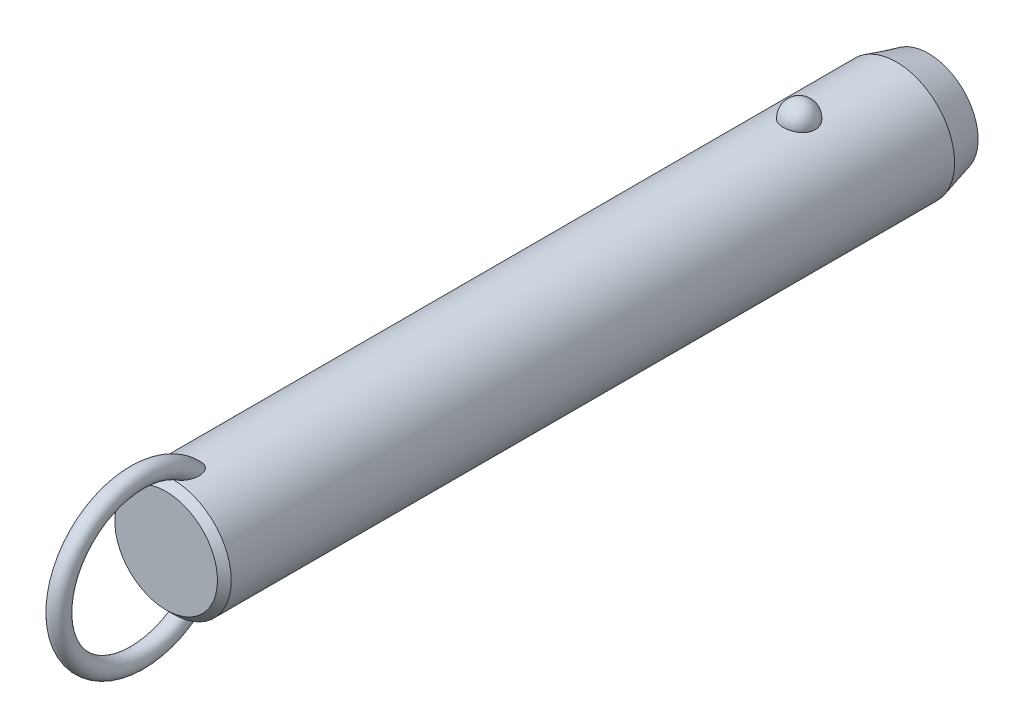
ISO-10303-21;
HEADER;
FILE_DESCRIPTION(('STEP AP214'),'2;1');
FILE_NAME('part.step','',(''),(''),'','','');
FILE_SCHEMA(('AUTOMOTIVE_DESIGN { 1 0 10303 214 1 1 1 1 }'));
ENDSEC;
DATA;
#1=APPLICATION_CONTEXT('core data for automotive mechanical design processes');
#2=APPLICATION_PROTOCOL_DEFINITION('international standard','automotive_design',2000,#1);
#3=PRODUCT_CONTEXT('',#1,'mechanical');
#4=PRODUCT('Part','Part','',(#3));
#5=PRODUCT_RELATED_PRODUCT_CATEGORY('part','',(#4));
#6=PRODUCT_DEFINITION_FORMATION('','',#4);
#7=PRODUCT_DEFINITION_CONTEXT('part definition',#1,'design');
#8=PRODUCT_DEFINITION('design','',#6,#7);
#9=PRODUCT_DEFINITION_SHAPE('','',#8);
#10=(LENGTH_UNIT() NAMED_UNIT(*) SI_UNIT(.MILLI.,.METRE.));
#11=(NAMED_UNIT(*) PLANE_ANGLE_UNIT() SI_UNIT($,.RADIAN.));
#12=(NAMED_UNIT(*) SI_UNIT($,.STERADIAN.) SOLID_ANGLE_UNIT());
#13=UNCERTAINTY_MEASURE_WITH_UNIT(LENGTH_MEASURE(1.E-05),#10,'distance_accuracy_value','');
#14=(GEOMETRIC_REPRESENTATION_CONTEXT(3) GLOBAL_UNCERTAINTY_ASSIGNED_CONTEXT((#13)) GLOBAL_UNIT_ASSIGNED_CONTEXT((#10,
#11,#12)) REPRESENTATION_CONTEXT('',''));
#15=CARTESIAN_POINT('',(0.,0.,0.));
#16=DIRECTION('',(0.,0.,1.));
#17=DIRECTION('',(1.,0.,0.));
#18=AXIS2_PLACEMENT_3D('',#15,#16,#17);
#19=CARTESIAN_POINT('',(0.,0.,121.9));
#20=DIRECTION('',(0.,0.,-1.));
#21=DIRECTION('',(-1.,0.,0.));
#22=AXIS2_PLACEMENT_3D('',#19,#20,#21);
#23=CYLINDRICAL_SURFACE('',#22,12.7);
#24=CARTESIAN_POINT('',(3.46661256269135,12.2177165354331,-3.5));
#25=CARTESIAN_POINT('',(3.4666090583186,12.2177194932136,-3.30432790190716));
#26=CARTESIAN_POINT('',(3.45063567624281,12.2222841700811,-3.10861112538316));
#27=CARTESIAN_POINT('',(3.38712451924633,12.2400345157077,-2.72271899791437));
#28=CARTESIAN_POINT('',(3.33957415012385,12.2532236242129,-2.53254588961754));
#29=CARTESIAN_POINT('',(3.2141234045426,12.286724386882,-2.16324948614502));
#30=CARTESIAN_POINT('',(3.13623639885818,12.3070329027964,-1.98412136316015));
#31=CARTESIAN_POINT('',(2.95205930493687,12.3525018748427,-1.64180592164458));
#32=CARTESIAN_POINT('',(2.84577003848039,12.3776621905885,-1.47861814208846));
#33=CARTESIAN_POINT('',(2.60688050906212,12.4301712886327,-1.17190583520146));
#34=CARTESIAN_POINT('',(2.47415697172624,12.4575299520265,-1.02847897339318));
#35=CARTESIAN_POINT('',(2.18615174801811,12.5112810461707,-0.766177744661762));
#36=CARTESIAN_POINT('',(2.03087002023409,12.5376734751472,-0.64730342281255));
#37=CARTESIAN_POINT('',(1.70237334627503,12.5864761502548,-0.437732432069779));
#38=CARTESIAN_POINT('',(1.52920948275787,12.6088972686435,-0.346958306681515));
#39=CARTESIAN_POINT('',(1.16944170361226,12.6473352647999,-0.195750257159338));
#40=CARTESIAN_POINT('',(0.982839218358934,12.663352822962,-0.135313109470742));
#41=CARTESIAN_POINT('',(0.604961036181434,12.6869706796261,-0.0473241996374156));
#42=CARTESIAN_POINT('',(0.41382314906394,12.6947125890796,-0.0192185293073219));
#43=CARTESIAN_POINT('',(0.0293827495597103,12.7014203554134,0.0051725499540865));
#44=CARTESIAN_POINT('',(-0.163919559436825,12.7003870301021,0.00146092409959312));
#45=CARTESIAN_POINT('',(-0.544374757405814,12.689735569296,-0.0373939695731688));
#46=CARTESIAN_POINT('',(-0.731575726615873,12.6802364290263,-0.0721015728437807));
#47=CARTESIAN_POINT('',(-1.09733277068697,12.6538333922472,-0.171364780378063));
#48=CARTESIAN_POINT('',(-1.27588869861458,12.6369293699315,-0.235920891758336));
#49=CARTESIAN_POINT('',(-1.6204698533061,12.5973946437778,-0.393548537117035));
#50=CARTESIAN_POINT('',(-1.78641865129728,12.5747321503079,-0.486778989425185));
#51=CARTESIAN_POINT('',(-2.10030671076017,12.5261316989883,-0.699110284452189));
#52=CARTESIAN_POINT('',(-2.24824419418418,12.5001934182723,-0.818213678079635));
#53=CARTESIAN_POINT('',(-2.52491489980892,12.4472906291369,-1.08157124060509));
#54=CARTESIAN_POINT('',(-2.65324222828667,12.4203160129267,-1.22624992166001));
#55=CARTESIAN_POINT('',(-2.88410007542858,12.3687509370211,-1.53528325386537));
#56=CARTESIAN_POINT('',(-2.98662883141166,12.3441606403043,-1.69963924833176));
#57=CARTESIAN_POINT('',(-3.16432417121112,12.2998199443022,-2.04548497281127));
#58=CARTESIAN_POINT('',(-3.23917525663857,12.2801261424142,-2.22714424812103));
#59=CARTESIAN_POINT('',(-3.35800573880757,12.248167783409,-2.6009138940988));
#60=CARTESIAN_POINT('',(-3.4019860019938,12.2359030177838,-2.79302397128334));
#61=CARTESIAN_POINT('',(-3.45784812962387,12.2202347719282,-3.18140279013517));
#62=CARTESIAN_POINT('',(-3.46986123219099,12.2167950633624,-3.37765118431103));
#63=CARTESIAN_POINT('',(-3.46186273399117,12.2190638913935,-3.76943689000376));
#64=CARTESIAN_POINT('',(-3.44185196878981,12.2247721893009,-3.96497421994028));
#65=CARTESIAN_POINT('',(-3.37048652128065,12.2446381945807,-4.34881728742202));
#66=CARTESIAN_POINT('',(-3.31928253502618,12.2587552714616,-4.53715319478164));
#67=CARTESIAN_POINT('',(-3.18693461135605,12.2938237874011,-4.90231727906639));
#68=CARTESIAN_POINT('',(-3.1057895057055,12.3147754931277,-5.07914500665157));
#69=CARTESIAN_POINT('',(-2.91506431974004,12.3613125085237,-5.41732059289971));
#70=CARTESIAN_POINT('',(-2.80533587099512,12.3869217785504,-5.57858147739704));
#71=CARTESIAN_POINT('',(-2.560414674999,12.4398525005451,-5.88013283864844));
#72=CARTESIAN_POINT('',(-2.42522099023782,12.4671740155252,-6.02042254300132));
#73=CARTESIAN_POINT('',(-2.1323357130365,12.5205965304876,-6.27662798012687));
#74=CARTESIAN_POINT('',(-1.97456596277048,12.5466928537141,-6.3924554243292));
#75=CARTESIAN_POINT('',(-1.64115839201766,12.5946384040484,-6.59583547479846));
#76=CARTESIAN_POINT('',(-1.46552179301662,12.6164879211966,-6.68339001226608));
#77=CARTESIAN_POINT('',(-1.10356050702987,12.6532533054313,-6.82682153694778));
#78=CARTESIAN_POINT('',(-0.9173913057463,12.6682500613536,-6.8830698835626));
#79=CARTESIAN_POINT('',(-0.537836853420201,12.6900288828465,-6.96386887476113));
#80=CARTESIAN_POINT('',(-0.344452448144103,12.6968119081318,-6.9884232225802));
#81=CARTESIAN_POINT('',(0.0402577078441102,12.7013667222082,-7.00496469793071));
#82=CARTESIAN_POINT('',(0.231556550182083,12.6993008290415,-6.99753844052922));
#83=CARTESIAN_POINT('',(0.610105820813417,12.6867505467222,-6.9516636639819));
#84=CARTESIAN_POINT('',(0.797356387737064,12.6762664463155,-6.913216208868));
#85=CARTESIAN_POINT('',(1.16186657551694,12.6480587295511,-6.80658431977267));
#86=CARTESIAN_POINT('',(1.33915951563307,12.6303611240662,-6.73850666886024));
#87=CARTESIAN_POINT('',(1.67968518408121,12.5896027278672,-6.5745087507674));
#88=CARTESIAN_POINT('',(1.84291705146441,12.5665416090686,-6.47858678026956));
#89=CARTESIAN_POINT('',(2.15340192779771,12.5171072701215,-6.25982455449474));
#90=CARTESIAN_POINT('',(2.30037831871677,12.4906895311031,-6.13660186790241));
#91=CARTESIAN_POINT('',(2.5717412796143,12.4376567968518,-5.86739587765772));
#92=CARTESIAN_POINT('',(2.69612388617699,12.4110417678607,-5.72140858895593));
#93=CARTESIAN_POINT('',(2.92107785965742,12.360051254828,-5.40794137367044));
#94=CARTESIAN_POINT('',(3.02121329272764,12.3357209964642,-5.24014110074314));
#95=CARTESIAN_POINT('',(3.19236291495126,12.2925446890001,-4.88969865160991));
#96=CARTESIAN_POINT('',(3.26338839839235,12.2736965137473,-4.70706226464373));
#97=CARTESIAN_POINT('',(3.36788038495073,12.245404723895,-4.35469510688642));
#98=CARTESIAN_POINT('',(3.40484026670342,12.2351018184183,-4.18605935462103));
#99=CARTESIAN_POINT('',(3.45420764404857,12.2212564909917,-3.84496058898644));
#100=CARTESIAN_POINT('',(3.46661565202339,12.2177139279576,-3.67249765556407));
#101=CARTESIAN_POINT('',(3.46661256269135,12.2177165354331,-3.5));
#102=B_SPLINE_CURVE_WITH_KNOTS('',3,(#24,#25,#26,#27,#28,#29,#30,#31,#32,#33,#34,#35,#36,#37,
#38,#39,#40,#41,#42,#43,#44,#45,#46,#47,#48,#49,#50,#51,#52,#53,#54,#55,#56,#57,#58,#59,#60,#61,
#62,#63,#64,#65,#66,#67,#68,#69,#70,#71,#72,#73,#74,#75,#76,#77,#78,#79,#80,#81,#82,#83,#84,#85,
#86,#87,#88,#89,#90,#91,#92,#93,#94,#95,#96,#97,#98,#99,#100,#101),.UNSPECIFIED.,.T.,.F.,(4,2,2,
2,2,2,2,2,2,2,2,2,2,2,2,2,2,2,2,2,2,2,2,2,2,2,2,2,2,2,2,2,2,2,2,2,2,2,4),(0.,0.586396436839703,
1.17302689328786,1.7593990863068,2.34575431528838,2.93491084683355,3.52406845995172,
4.11158733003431,4.69904375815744,5.2762784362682,5.85345931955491,6.42265312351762,
6.99185659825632,7.56427334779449,8.136746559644,8.71981013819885,9.3029135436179,
9.89247258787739,10.4820150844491,11.0691335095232,11.6562366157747,12.2405256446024,
12.8248374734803,13.412244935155,13.9996740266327,14.5891883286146,15.1786623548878,
15.7609861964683,16.3432419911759,16.9148635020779,17.4864654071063,18.0560241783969,
18.6256177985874,19.2037609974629,19.7820055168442,20.3699810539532,20.957728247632,
21.4746855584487,21.9916320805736),.UNSPECIFIED.);
#103=CARTESIAN_POINT('',(3.46661256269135,12.2177165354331,-3.5));
#104=VERTEX_POINT('',#103);
#105=EDGE_CURVE('E41',#104,#104,#102,.T.);
#106=ORIENTED_EDGE('',*,*,#105,.T.);
#107=EDGE_LOOP('',(#106));
#108=FACE_BOUND('',#107,.T.);
#109=CARTESIAN_POINT('',(0.,0.,133.1));
#110=DIRECTION('',(0.,0.,1.));
#111=DIRECTION('',(1.,0.,0.));
#112=AXIS2_PLACEMENT_3D('',#109,#110,#111);
#113=CIRCLE('',#112,12.7);
#114=CARTESIAN_POINT('',(12.7,0.,133.1));
#115=VERTEX_POINT('',#114);
#116=EDGE_CURVE('E10',#115,#115,#113,.F.);
#117=ORIENTED_EDGE('',*,*,#116,.T.);
#118=EDGE_LOOP('',(#117));
#119=FACE_BOUND('',#118,.T.);
#120=CARTESIAN_POINT('',(-0.548122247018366,-12.6881662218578,126.843218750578));
#121=CARTESIAN_POINT('',(-0.648865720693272,-12.6838128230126,126.877926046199));
#122=CARTESIAN_POINT('',(-0.746398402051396,-12.6783867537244,126.922042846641));
#123=CARTESIAN_POINT('',(-0.932125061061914,-12.666091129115,127.026764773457));
#124=CARTESIAN_POINT('',(-1.02030388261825,-12.6592192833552,127.087396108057));
#125=CARTESIAN_POINT('',(-1.18487740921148,-12.6448747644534,127.221847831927));
#126=CARTESIAN_POINT('',(-1.26134296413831,-12.637406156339,127.295582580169));
#127=CARTESIAN_POINT('',(-1.4023120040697,-12.6225412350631,127.453604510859));
#128=CARTESIAN_POINT('',(-1.466814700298,-12.6151449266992,127.53789238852));
#129=CARTESIAN_POINT('',(-1.60714786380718,-12.5981718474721,127.749657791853));
#130=CARTESIAN_POINT('',(-1.67725126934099,-12.588900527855,127.880962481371));
#131=CARTESIAN_POINT('',(-1.79536591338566,-12.5725964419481,128.153247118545));
#132=CARTESIAN_POINT('',(-1.84333535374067,-12.5655679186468,128.294244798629));
#133=CARTESIAN_POINT('',(-1.93422576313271,-12.5519624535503,128.637645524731));
#134=CARTESIAN_POINT('',(-1.96788773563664,-12.5466298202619,128.842557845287));
#135=CARTESIAN_POINT('',(-1.9941399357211,-12.542463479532,129.151760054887));
#136=CARTESIAN_POINT('',(-1.99883864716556,-12.5417153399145,129.255298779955));
#137=CARTESIAN_POINT('',(-2.00078003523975,-12.5414074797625,129.46245124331));
#138=CARTESIAN_POINT('',(-1.99802449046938,-12.5418474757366,129.566064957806));
#139=CARTESIAN_POINT('',(-1.98336733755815,-12.5441750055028,129.81032076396));
#140=CARTESIAN_POINT('',(-1.96851430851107,-12.5465291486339,129.950780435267));
#141=CARTESIAN_POINT('',(-1.92707089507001,-12.5529612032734,130.229960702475));
#142=CARTESIAN_POINT('',(-1.90047458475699,-12.5570399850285,130.368680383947));
#143=CARTESIAN_POINT('',(-1.8361912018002,-12.5666008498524,130.64341135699));
#144=CARTESIAN_POINT('',(-1.79850828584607,-12.57208240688,130.779423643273));
#145=CARTESIAN_POINT('',(-1.71223796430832,-12.5841228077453,131.047842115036));
#146=CARTESIAN_POINT('',(-1.66365679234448,-12.5906810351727,131.180250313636));
#147=CARTESIAN_POINT('',(-1.5780450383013,-12.6016176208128,131.38548877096));
#148=CARTESIAN_POINT('',(-1.54477252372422,-12.6057501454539,131.459914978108));
#149=CARTESIAN_POINT('',(-1.47424480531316,-12.6141930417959,131.606839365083));
#150=CARTESIAN_POINT('',(-1.436990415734,-12.6185033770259,131.679337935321));
#151=CARTESIAN_POINT('',(-1.35825795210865,-12.6272207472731,131.821892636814));
#152=CARTESIAN_POINT('',(-1.31678520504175,-12.6316276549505,131.891951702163));
#153=CARTESIAN_POINT('',(-1.22917793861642,-12.6404532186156,132.029070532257));
#154=CARTESIAN_POINT('',(-1.18304514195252,-12.6448718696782,132.096131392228));
#155=CARTESIAN_POINT('',(-1.0724641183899,-12.6547893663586,132.243874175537));
#156=CARTESIAN_POINT('',(-1.00642239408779,-12.6602600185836,132.323384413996));
#157=CARTESIAN_POINT('',(-0.864441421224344,-12.6707460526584,132.473169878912));
#158=CARTESIAN_POINT('',(-0.78851691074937,-12.6757620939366,132.543458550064));
#159=CARTESIAN_POINT('',(-0.65221547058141,-12.6833591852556,132.648680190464));
#160=CARTESIAN_POINT('',(-0.59498203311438,-12.6861973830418,132.687624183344));
#161=CARTESIAN_POINT('',(-0.475269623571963,-12.6912445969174,132.756489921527));
#162=CARTESIAN_POINT('',(-0.412800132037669,-12.6934547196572,132.786427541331));
#163=CARTESIAN_POINT('',(-0.295749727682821,-12.6966636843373,132.829756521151));
#164=CARTESIAN_POINT('',(-0.241949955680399,-12.6978134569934,132.845218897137));
#165=CARTESIAN_POINT('',(-0.132508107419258,-12.6994261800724,132.866884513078));
#166=CARTESIAN_POINT('',(-0.0768679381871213,-12.6998898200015,132.873097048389));
#167=CARTESIAN_POINT('',(0.0347696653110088,-12.7000752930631,132.875583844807));
#168=CARTESIAN_POINT('',(0.0907676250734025,-12.6997954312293,132.871835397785));
#169=CARTESIAN_POINT('',(0.201283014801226,-12.6985255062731,132.854788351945));
#170=CARTESIAN_POINT('',(0.255799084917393,-12.6975348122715,132.841481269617));
#171=CARTESIAN_POINT('',(0.376042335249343,-12.6946091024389,132.80203792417));
#172=CARTESIAN_POINT('',(0.440950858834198,-12.6924943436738,132.773449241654));
#173=CARTESIAN_POINT('',(0.565350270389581,-12.6875639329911,132.706323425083));
#174=CARTESIAN_POINT('',(0.624828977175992,-12.6847467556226,132.667764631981));
#175=CARTESIAN_POINT('',(0.774116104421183,-12.6767252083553,132.556949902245));
#176=CARTESIAN_POINT('',(0.859449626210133,-12.6711344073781,132.478760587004));
#177=CARTESIAN_POINT('',(1.01789440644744,-12.6593922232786,132.310943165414));
#178=CARTESIAN_POINT('',(1.09096902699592,-12.653239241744,132.221282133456));
#179=CARTESIAN_POINT('',(1.22268793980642,-12.6411674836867,132.040265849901));
#180=CARTESIAN_POINT('',(1.28193986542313,-12.6352572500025,131.949345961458));
#181=CARTESIAN_POINT('',(1.39259777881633,-12.6235401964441,131.762792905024));
#182=CARTESIAN_POINT('',(1.44399707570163,-12.6177334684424,131.667155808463));
#183=CARTESIAN_POINT('',(1.53972870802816,-12.6064093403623,131.472273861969));
#184=CARTESIAN_POINT('',(1.58405262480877,-12.6008922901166,131.373024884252));
#185=CARTESIAN_POINT('',(1.66600705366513,-12.5903187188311,131.171772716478));
#186=CARTESIAN_POINT('',(1.70363651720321,-12.5852622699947,131.069769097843));
#187=CARTESIAN_POINT('',(1.77545379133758,-12.5753406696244,130.854358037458));
#188=CARTESIAN_POINT('',(1.80903453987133,-12.5705328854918,130.740745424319));
#189=CARTESIAN_POINT('',(1.86844163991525,-12.5618400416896,130.511457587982));
#190=CARTESIAN_POINT('',(1.89426665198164,-12.5579551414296,130.395782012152));
#191=CARTESIAN_POINT('',(1.9378546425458,-12.5513030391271,130.163007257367));
#192=CARTESIAN_POINT('',(1.95562640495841,-12.5485346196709,130.045909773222));
#193=CARTESIAN_POINT('',(1.98264463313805,-12.5442934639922,129.810747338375));
#194=CARTESIAN_POINT('',(1.99189298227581,-12.5428204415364,129.69268260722));
#195=CARTESIAN_POINT('',(2.00416068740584,-12.540871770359,129.380622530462));
#196=CARTESIAN_POINT('',(1.99944433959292,-12.541631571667,129.186229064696));
#197=CARTESIAN_POINT('',(1.96113755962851,-12.5476846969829,128.800309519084));
#198=CARTESIAN_POINT('',(1.92758341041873,-12.5529723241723,128.608780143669));
#199=CARTESIAN_POINT('',(1.83934342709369,-12.5661532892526,128.282272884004));
#200=CARTESIAN_POINT('',(1.79215440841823,-12.5730485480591,128.14524997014));
#201=CARTESIAN_POINT('',(1.67676242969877,-12.588958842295,127.880445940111));
#202=CARTESIAN_POINT('',(1.60859050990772,-12.597970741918,127.752651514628));
#203=CARTESIAN_POINT('',(1.46583832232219,-12.6152829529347,127.535800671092));
#204=CARTESIAN_POINT('',(1.39525727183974,-12.6233659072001,127.44410500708));
#205=CARTESIAN_POINT('',(1.23992594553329,-12.6395676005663,127.273485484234));
#206=CARTESIAN_POINT('',(1.15517932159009,-12.6476863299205,127.194558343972));
#207=CARTESIAN_POINT('',(0.971995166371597,-12.6630846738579,127.052643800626));
#208=CARTESIAN_POINT('',(0.873456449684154,-12.6703572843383,126.989784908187));
#209=CARTESIAN_POINT('',(0.665847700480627,-12.6829569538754,126.884487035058));
#210=CARTESIAN_POINT('',(0.556784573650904,-12.688285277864,126.842034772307));
#211=CARTESIAN_POINT('',(0.347338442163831,-12.6956226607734,126.784443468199));
#212=CARTESIAN_POINT('',(0.247759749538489,-12.6979816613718,126.766399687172));
#213=CARTESIAN_POINT('',(0.0470218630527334,-12.7003077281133,126.748600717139));
#214=CARTESIAN_POINT('',(-0.0541350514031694,-12.7002779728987,126.748821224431));
#215=CARTESIAN_POINT('',(-0.221414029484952,-12.6982482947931,126.764363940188));
#216=CARTESIAN_POINT('',(-0.288055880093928,-12.6969033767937,126.774666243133));
#217=CARTESIAN_POINT('',(-0.419599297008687,-12.6932369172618,126.80313489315));
#218=CARTESIAN_POINT('',(-0.484501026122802,-12.6909154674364,126.821300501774));
#219=CARTESIAN_POINT('',(-0.548122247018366,-12.6881662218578,126.843218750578));
#220=B_SPLINE_CURVE_WITH_KNOTS('',3,(#120,#121,#122,#123,#124,#125,#126,#127,#128,#129,#130,
#131,#132,#133,#134,#135,#136,#137,#138,#139,#140,#141,#142,#143,#144,#145,#146,#147,#148,#149,
#150,#151,#152,#153,#154,#155,#156,#157,#158,#159,#160,#161,#162,#163,#164,#165,#166,#167,#168,
#169,#170,#171,#172,#173,#174,#175,#176,#177,#178,#179,#180,#181,#182,#183,#184,#185,#186,#187,
#188,#189,#190,#191,#192,#193,#194,#195,#196,#197,#198,#199,#200,#201,#202,#203,#204,#205,#206,
#207,#208,#209,#210,#211,#212,#213,#214,#215,#216,#217,#218,#219),.UNSPECIFIED.,.T.,.F.,(4,2,2,
2,2,2,2,2,2,2,2,2,2,2,2,2,2,2,2,2,2,2,2,2,2,2,2,2,2,2,2,2,2,2,2,2,2,2,2,2,2,2,2,2,2,2,2,2,2,4),
(0.,0.31964225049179,0.639794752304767,0.957927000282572,1.27608021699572,1.72100165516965,
2.16675988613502,2.78630021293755,3.09705782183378,3.40774128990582,3.83096358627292,
4.25439969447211,4.67767724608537,5.10071330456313,5.34550297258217,5.59024267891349,
5.83467707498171,6.07902143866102,6.38891080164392,6.69834321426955,6.9056091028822,
7.11250749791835,7.27977315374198,7.44687060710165,7.61434932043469,7.78197685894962,
7.99365544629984,8.20579780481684,8.55147335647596,8.89816429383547,9.22375138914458,
9.54961437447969,9.87586224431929,10.202161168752,10.557587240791,10.9130746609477,
11.2681734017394,11.6231936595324,12.2046601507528,12.7853961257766,13.219164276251,
13.6522938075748,13.9989174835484,14.3454519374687,14.6946768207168,15.0436740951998,
15.3457513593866,15.6474266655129,15.8493051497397,16.0511646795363),.UNSPECIFIED.);
#221=CARTESIAN_POINT('',(-0.548122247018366,-12.6881662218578,126.843218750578));
#222=VERTEX_POINT('',#221);
#223=EDGE_CURVE('E60',#222,#222,#220,.T.);
#224=ORIENTED_EDGE('',*,*,#223,.T.);
#225=EDGE_LOOP('',(#224));
#226=FACE_BOUND('',#225,.T.);
#227=CARTESIAN_POINT('',(-0.548122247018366,12.6881662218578,126.843218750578));
#228=CARTESIAN_POINT('',(-0.459436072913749,12.6919968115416,126.812673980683));
#229=CARTESIAN_POINT('',(-0.368189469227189,12.6949996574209,126.789391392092));
#230=CARTESIAN_POINT('',(-0.18302400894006,12.6990186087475,126.758406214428));
#231=CARTESIAN_POINT('',(-0.0891049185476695,12.7000345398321,126.750704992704));
#232=CARTESIAN_POINT('',(0.0987147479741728,12.6999636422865,126.751245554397));
#233=CARTESIAN_POINT('',(0.192615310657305,12.6988761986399,126.759492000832));
#234=CARTESIAN_POINT('',(0.377658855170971,12.6947211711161,126.791551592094));
#235=CARTESIAN_POINT('',(0.468801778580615,12.6916535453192,126.815365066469));
#236=CARTESIAN_POINT('',(0.645809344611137,12.6838788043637,126.87745651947));
#237=CARTESIAN_POINT('',(0.731679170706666,12.6791733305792,126.915720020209));
#238=CARTESIAN_POINT('',(0.896315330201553,12.6686004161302,127.005120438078));
#239=CARTESIAN_POINT('',(0.97508059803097,12.6627328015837,127.056259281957));
#240=CARTESIAN_POINT('',(1.12963655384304,12.6499161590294,127.17367820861));
#241=CARTESIAN_POINT('',(1.20478673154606,12.6429194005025,127.240792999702));
#242=CARTESIAN_POINT('',(1.34448241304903,12.6288282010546,127.38522507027));
#243=CARTESIAN_POINT('',(1.40902173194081,12.621733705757,127.462548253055));
#244=CARTESIAN_POINT('',(1.55208211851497,12.6050877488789,127.659247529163));
#245=CARTESIAN_POINT('',(1.62510490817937,12.5957546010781,127.782654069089));
#246=CARTESIAN_POINT('',(1.7501904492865,12.5789823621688,128.039769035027));
#247=CARTESIAN_POINT('',(1.8022137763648,12.5715468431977,128.173496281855));
#248=CARTESIAN_POINT('',(1.90309965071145,12.5567434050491,128.498351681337));
#249=CARTESIAN_POINT('',(1.94342317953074,12.5504515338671,128.692161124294));
#250=CARTESIAN_POINT('',(1.99332997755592,12.5426147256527,129.08378810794));
#251=CARTESIAN_POINT('',(2.00285305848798,12.5410790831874,129.281612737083));
#252=CARTESIAN_POINT('',(1.99678999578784,12.5420407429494,129.616642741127));
#253=CARTESIAN_POINT('',(1.98794117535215,12.5434564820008,129.754042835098));
#254=CARTESIAN_POINT('',(1.95865119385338,12.5480641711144,130.027639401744));
#255=CARTESIAN_POINT('',(1.93820436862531,12.5512569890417,130.163835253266));
#256=CARTESIAN_POINT('',(1.88647896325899,12.5591352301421,130.434249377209));
#257=CARTESIAN_POINT('',(1.85518800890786,12.5638223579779,130.568465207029));
#258=CARTESIAN_POINT('',(1.78217886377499,12.5743868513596,130.833936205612));
#259=CARTESIAN_POINT('',(1.74046509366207,12.5802637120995,130.965192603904));
#260=CARTESIAN_POINT('',(1.66024095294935,12.5910571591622,131.186085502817));
#261=CARTESIAN_POINT('',(1.62434772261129,12.5957535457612,131.276690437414));
#262=CARTESIAN_POINT('',(1.54709009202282,12.6054762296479,131.455512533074));
#263=CARTESIAN_POINT('',(1.50572681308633,12.6105024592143,131.543730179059));
#264=CARTESIAN_POINT('',(1.41728020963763,12.620748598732,131.716932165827));
#265=CARTESIAN_POINT('',(1.37021377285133,12.625967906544,131.801925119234));
#266=CARTESIAN_POINT('',(1.26969620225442,12.6364721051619,131.968007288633));
#267=CARTESIAN_POINT('',(1.21624929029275,12.6417569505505,132.049099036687));
#268=CARTESIAN_POINT('',(1.10304413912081,12.6521331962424,132.204702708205));
#269=CARTESIAN_POINT('',(1.04340936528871,12.657226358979,132.279303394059));
#270=CARTESIAN_POINT('',(0.915919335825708,12.667090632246,132.421324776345));
#271=CARTESIAN_POINT('',(0.848064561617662,12.6718617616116,132.48874589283));
#272=CARTESIAN_POINT('',(0.717035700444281,12.67987711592,132.600624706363));
#273=CARTESIAN_POINT('',(0.655526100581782,12.6832377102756,132.646997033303));
#274=CARTESIAN_POINT('',(0.525985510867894,12.6892676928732,132.729619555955));
#275=CARTESIAN_POINT('',(0.457969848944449,12.6919386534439,132.765892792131));
#276=CARTESIAN_POINT('',(0.334859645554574,12.695691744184,132.816657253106));
#277=CARTESIAN_POINT('',(0.281116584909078,12.6970073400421,132.834373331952));
#278=CARTESIAN_POINT('',(0.171425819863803,12.6989609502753,132.860642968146));
#279=CARTESIAN_POINT('',(0.115480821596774,12.699599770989,132.869207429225));
#280=CARTESIAN_POINT('',(0.00272618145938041,12.7001251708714,132.876253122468));
#281=CARTESIAN_POINT('',(-0.0540859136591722,12.7000089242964,132.874696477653));
#282=CARTESIAN_POINT('',(-0.16654462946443,12.6990328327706,132.861600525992));
#283=CARTESIAN_POINT('',(-0.222190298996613,12.6981724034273,132.850053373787));
#284=CARTESIAN_POINT('',(-0.342018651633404,12.695562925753,132.814912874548));
#285=CARTESIAN_POINT('',(-0.405606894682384,12.6936676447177,132.78933225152));
#286=CARTESIAN_POINT('',(-0.527815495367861,12.6891754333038,132.728311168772));
#287=CARTESIAN_POINT('',(-0.586425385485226,12.6865770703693,132.692850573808));
#288=CARTESIAN_POINT('',(-0.731842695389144,12.6792129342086,132.591496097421));
#289=CARTESIAN_POINT('',(-0.81470941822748,12.6740767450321,132.5200395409));
#290=CARTESIAN_POINT('',(-0.969101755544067,12.6632083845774,132.36589007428));
#291=CARTESIAN_POINT('',(-1.04059564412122,12.6574746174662,132.283166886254));
#292=CARTESIAN_POINT('',(-1.16981116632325,12.6461638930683,132.115809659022));
#293=CARTESIAN_POINT('',(-1.22811369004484,12.6405994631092,132.031616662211));
#294=CARTESIAN_POINT('',(-1.33743405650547,12.6295007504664,131.858579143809));
#295=CARTESIAN_POINT('',(-1.38844577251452,12.6239664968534,131.769730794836));
#296=CARTESIAN_POINT('',(-1.48400702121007,12.6130898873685,131.588389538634));
#297=CARTESIAN_POINT('',(-1.52854232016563,12.6077479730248,131.495889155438));
#298=CARTESIAN_POINT('',(-1.61150113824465,12.5974127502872,131.308160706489));
#299=CARTESIAN_POINT('',(-1.64992317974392,12.5924195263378,131.212931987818));
#300=CARTESIAN_POINT('',(-1.73468589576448,12.581070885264,130.98289362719));
#301=CARTESIAN_POINT('',(-1.77831261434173,12.5749388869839,130.847066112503));
#302=CARTESIAN_POINT('',(-1.85439734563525,12.5639437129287,130.572212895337));
#303=CARTESIAN_POINT('',(-1.88684994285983,12.5590811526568,130.433185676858));
#304=CARTESIAN_POINT('',(-1.94008483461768,12.550968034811,130.15309235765));
#305=CARTESIAN_POINT('',(-1.96088706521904,12.5477147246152,130.012030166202));
#306=CARTESIAN_POINT('',(-1.99000539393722,12.5431291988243,129.728668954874));
#307=CARTESIAN_POINT('',(-1.99832911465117,12.5417958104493,129.586370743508));
#308=CARTESIAN_POINT('',(-2.00166624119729,12.5412674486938,129.257627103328));
#309=CARTESIAN_POINT('',(-1.99178843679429,12.5428579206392,129.071088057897));
#310=CARTESIAN_POINT('',(-1.94455183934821,12.5502731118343,128.70162404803));
#311=CARTESIAN_POINT('',(-1.90724032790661,12.5560905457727,128.518693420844));
#312=CARTESIAN_POINT('',(-1.81330718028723,12.5699462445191,128.204848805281));
#313=CARTESIAN_POINT('',(-1.76338820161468,12.5771273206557,128.071910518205));
#314=CARTESIAN_POINT('',(-1.64305018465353,12.593414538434,127.815681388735));
#315=CARTESIAN_POINT('',(-1.57265346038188,12.6025185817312,127.692380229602));
#316=CARTESIAN_POINT('',(-1.42634956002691,12.6198178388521,127.483564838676));
#317=CARTESIAN_POINT('',(-1.35423772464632,12.6278405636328,127.395384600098));
#318=CARTESIAN_POINT('',(-1.19645664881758,12.6437632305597,127.232107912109));
#319=CARTESIAN_POINT('',(-1.1108053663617,12.6516633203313,127.156994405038));
#320=CARTESIAN_POINT('',(-0.947219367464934,12.6648319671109,127.037811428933));
#321=CARTESIAN_POINT('',(-0.871624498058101,12.670300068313,126.990541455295));
#322=CARTESIAN_POINT('',(-0.714161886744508,12.6801492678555,126.9077413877));
#323=CARTESIAN_POINT('',(-0.632295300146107,12.684530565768,126.87220913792));
#324=CARTESIAN_POINT('',(-0.548122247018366,12.6881662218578,126.843218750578));
#325=B_SPLINE_CURVE_WITH_KNOTS('',3,(#227,#228,#229,#230,#231,#232,#233,#234,#235,#236,#237,
#238,#239,#240,#241,#242,#243,#244,#245,#246,#247,#248,#249,#250,#251,#252,#253,#254,#255,#256,
#257,#258,#259,#260,#261,#262,#263,#264,#265,#266,#267,#268,#269,#270,#271,#272,#273,#274,#275,
#276,#277,#278,#279,#280,#281,#282,#283,#284,#285,#286,#287,#288,#289,#290,#291,#292,#293,#294,
#295,#296,#297,#298,#299,#300,#301,#302,#303,#304,#305,#306,#307,#308,#309,#310,#311,#312,#313,
#314,#315,#316,#317,#318,#319,#320,#321,#322,#323,#324),.UNSPECIFIED.,.T.,.F.,(4,2,2,2,2,2,2,2,
2,2,2,2,2,2,2,2,2,2,2,2,2,2,2,2,2,2,2,2,2,2,2,2,2,2,2,2,2,2,2,2,2,2,2,2,2,2,2,2,4),(0.,
0.281328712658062,0.562682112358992,0.844117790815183,1.12555942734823,1.40671982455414,
1.68792232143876,1.98972294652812,2.29169886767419,2.72039860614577,3.14989948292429,
3.74084916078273,4.33295293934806,4.74554109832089,5.15833092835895,5.57159335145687,
5.98468079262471,6.27722775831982,6.56971484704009,6.86135609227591,7.15280542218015,
7.43927407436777,7.72572595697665,7.95635862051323,8.18646071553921,8.35559393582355,
8.52452541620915,8.69408946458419,8.86378678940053,9.06834348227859,9.27332014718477,
9.60010414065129,9.92778432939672,10.2350252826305,10.5425229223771,10.8506864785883,
11.15892440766,11.5867893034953,12.0148612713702,12.4421984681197,12.8692745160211,
13.4279365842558,13.9856380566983,14.4107062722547,14.835313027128,15.1765567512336,
15.517351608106,15.7844129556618,16.051425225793),.UNSPECIFIED.);
#326=CARTESIAN_POINT('',(-0.548122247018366,12.6881662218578,126.843218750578));
#327=VERTEX_POINT('',#326);
#328=EDGE_CURVE('E68',#327,#327,#325,.T.);
#329=ORIENTED_EDGE('',*,*,#328,.T.);
#330=EDGE_LOOP('',(#329));
#331=FACE_BOUND('',#330,.T.);
#332=CARTESIAN_POINT('',(0.,0.,-24.6999999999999));
#333=DIRECTION('',(0.,0.,-1.));
#334=DIRECTION('',(-1.,0.,0.));
#335=AXIS2_PLACEMENT_3D('',#332,#333,#334);
#336=CIRCLE('',#335,12.7);
#337=CARTESIAN_POINT('',(-12.7,0.,-24.6999999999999));
#338=VERTEX_POINT('',#337);
#339=EDGE_CURVE('E57',#338,#338,#336,.F.);
#340=ORIENTED_EDGE('',*,*,#339,.T.);
#341=EDGE_LOOP('',(#340));
#342=FACE_BOUND('',#341,.T.);
#343=ADVANCED_FACE('F37',(#108,#119,#226,#331,#342),#23,.T.);
#344=CARTESIAN_POINT('',(0.,0.,-31.7));
#345=DIRECTION('',(0.,0.,-1.));
#346=DIRECTION('',(-1.,0.,0.));
#347=AXIS2_PLACEMENT_3D('',#344,#345,#346);
#348=PLANE('',#347);
#349=CARTESIAN_POINT('',(0.,0.,-31.7));
#350=DIRECTION('',(0.,0.,-1.));
#351=DIRECTION('',(-1.,0.,0.));
#352=AXIS2_PLACEMENT_3D('',#349,#350,#351);
#353=CIRCLE('',#352,10.8243556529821);
#354=CARTESIAN_POINT('',(-10.8243556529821,0.,-31.7));
#355=VERTEX_POINT('',#354);
#356=EDGE_CURVE('E67',#355,#355,#353,.T.);
#357=ORIENTED_EDGE('',*,*,#356,.T.);
#358=EDGE_LOOP('',(#357));
#359=FACE_BOUND('',#358,.T.);
#360=ADVANCED_FACE('F86',(#359),#348,.T.);
#361=CARTESIAN_POINT('',(0.,0.,-31.7));
#362=DIRECTION('',(0.,0.,1.));
#363=DIRECTION('',(1.,0.,0.));
#364=AXIS2_PLACEMENT_3D('',#361,#362,#363);
#365=CONICAL_SURFACE('',#364,10.8243556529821,0.261799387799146);
#366=ORIENTED_EDGE('',*,*,#339,.F.);
#367=EDGE_LOOP('',(#366));
#368=FACE_BOUND('',#367,.T.);
#369=ORIENTED_EDGE('',*,*,#356,.F.);
#370=EDGE_LOOP('',(#369));
#371=FACE_BOUND('',#370,.T.);
#372=ADVANCED_FACE('F84',(#368,#371),#365,.T.);
#373=CARTESIAN_POINT('',(0.,0.,134.6));
#374=DIRECTION('',(0.,0.,1.));
#375=DIRECTION('',(1.,0.,0.));
#376=AXIS2_PLACEMENT_3D('',#373,#374,#375);
#377=PLANE('',#376);
#378=CARTESIAN_POINT('',(0.,0.,134.6));
#379=DIRECTION('',(0.,0.,1.));
#380=DIRECTION('',(1.,0.,0.));
#381=AXIS2_PLACEMENT_3D('',#378,#379,#380);
#382=CIRCLE('',#381,11.2);
#383=CARTESIAN_POINT('',(11.2,0.,134.6));
#384=VERTEX_POINT('',#383);
#385=EDGE_CURVE('E50',#384,#384,#382,.T.);
#386=ORIENTED_EDGE('',*,*,#385,.T.);
#387=EDGE_LOOP('',(#386));
#388=FACE_BOUND('',#387,.T.);
#389=ADVANCED_FACE('F78',(#388),#377,.T.);
#390=CARTESIAN_POINT('',(0.,0.,140.95));
#391=DIRECTION('',(1.,0.,0.));
#392=DIRECTION('',(0.,0.,-1.));
#393=AXIS2_PLACEMENT_3D('',#390,#391,#392);
#394=TOROIDAL_SURFACE('',#393,17.05,2.);
#395=ORIENTED_EDGE('',*,*,#328,.F.);
#396=EDGE_LOOP('',(#395));
#397=FACE_BOUND('',#396,.T.);
#398=ORIENTED_EDGE('',*,*,#223,.F.);
#399=EDGE_LOOP('',(#398));
#400=FACE_BOUND('',#399,.T.);
#401=ADVANCED_FACE('F74',(#397,#400),#394,.T.);
#402=CARTESIAN_POINT('',(0.,0.,134.6));
#403=DIRECTION('',(0.,0.,-1.));
#404=DIRECTION('',(-1.,0.,0.));
#405=AXIS2_PLACEMENT_3D('',#402,#403,#404);
#406=CONICAL_SURFACE('',#405,11.2,0.785398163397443);
#407=ORIENTED_EDGE('',*,*,#116,.F.);
#408=EDGE_LOOP('',(#407));
#409=FACE_BOUND('',#408,.T.);
#410=ORIENTED_EDGE('',*,*,#385,.F.);
#411=EDGE_LOOP('',(#410));
#412=FACE_BOUND('',#411,.T.);
#413=ADVANCED_FACE('F39',(#409,#412),#406,.T.);
#414=CARTESIAN_POINT('',(0.,12.7,-3.5));
#415=DIRECTION('',(0.,1.,0.));
#416=DIRECTION('',(0.,0.,-1.));
#417=AXIS2_PLACEMENT_3D('',#414,#415,#416);
#418=SPHERICAL_SURFACE('',#417,3.5);
#419=ORIENTED_EDGE('',*,*,#105,.F.);
#420=EDGE_LOOP('',(#419));
#421=FACE_BOUND('',#420,.T.);
#422=ADVANCED_FACE('F80',(#421),#418,.T.);
#423=CLOSED_SHELL('',(#343,#360,#372,#389,#401,#413,#422));
#424=MANIFOLD_SOLID_BREP('B2',#423);
#425=ADVANCED_BREP_SHAPE_REPRESENTATION('',(#18,#424),#14);
#426=SHAPE_DEFINITION_REPRESENTATION(#9,#425);
ENDSEC;
END-ISO-10303-21;
